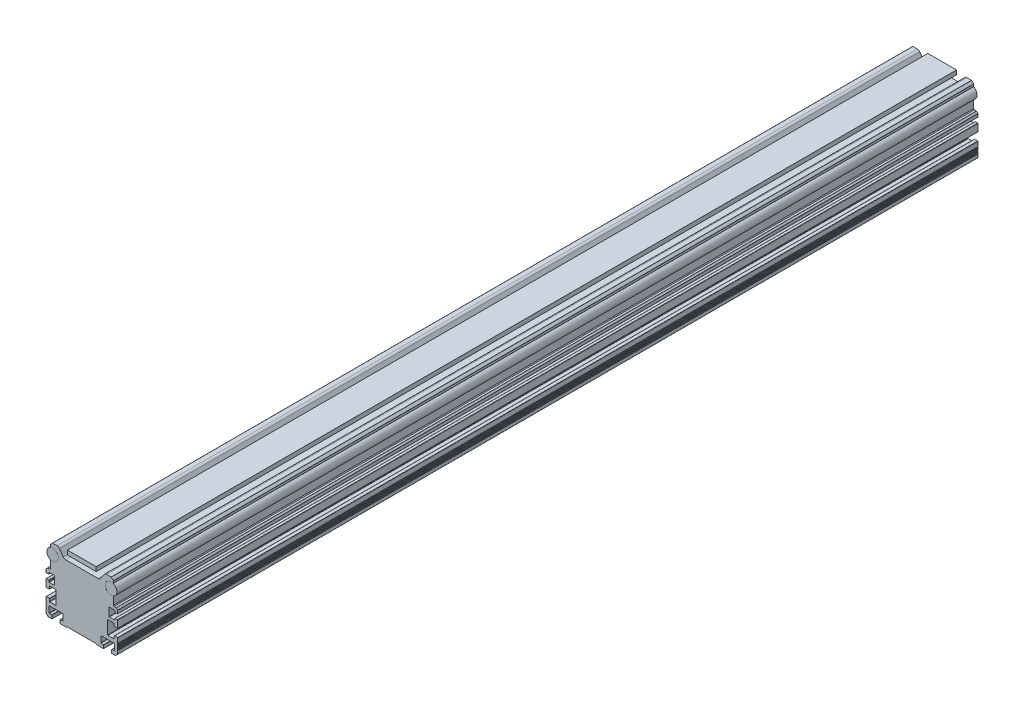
from build123d import *

# Parameters (mm, degrees)
EXTRUDE_1_DEPTH     = 600
SKETCH_3_R          = 0.25
CUT_EXTRUDE_1_DEPTH = 604.068916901
SKETCH_5_R          = 4
EXTRUDE_2_DEPTH     = 600
EXTRUDE_2_2_DEPTH   = 600
SKETCH_6_W          = 20
SKETCH_6_H          = 3
EXTRUDE_3_DEPTH     = 600


with BuildPart() as part:
    # Sketch 2 → Extrude 1 (new body)
    with BuildSketch(Plane.XY):
        with BuildLine():
            Line((4.012824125, 22.052472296), (4.012824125, 16.712270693))
            Line((4.012824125, 16.712270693), (3.512823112, 16.212270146))
            Line((3.512823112, 16.212270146), (2.095666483, 16.212270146))
            ThreePointArc((2.095666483, 16.212270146), (2.019129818, 16.197046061), (1.954245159, 16.153691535))
            Line((1.954245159, 16.153691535), (1.07140231, 15.270849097))
            ThreePointArc((1.07140231, 15.270849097), (1.028047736, 15.205964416), (1.012823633, 15.129427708))
            Line((1.012823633, 15.129427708), (1.012823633, 13.106220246))
            ThreePointArc((1.012823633, 13.106220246), (1.071402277, 12.96479889), (1.212823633, 12.906220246))
            Line((1.212823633, 12.906220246), (2.812823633, 12.906220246))
            ThreePointArc((2.812823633, 12.906220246), (2.95424499, 12.96479889), (3.012823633, 13.106220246))
            Line((3.012823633, 13.106220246), (3.012823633, 13.956220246))
            ThreePointArc((3.012823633, 13.956220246), (3.071402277, 14.097641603), (3.212823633, 14.156220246))
            Line((3.212823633, 14.156220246), (6.812823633, 14.156220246))
            ThreePointArc((6.812823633, 14.156220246), (6.95424499, 14.097641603), (7.012823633, 13.956220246))
            Line((7.012823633, 13.956220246), (7.012823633, 8.356220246))
            ThreePointArc((7.012823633, 8.356220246), (6.95424499, 8.21479889), (6.812823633, 8.156220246))
            Line((6.812823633, 8.156220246), (3.212823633, 8.156220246))
            ThreePointArc((3.212823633, 8.156220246), (3.071402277, 8.21479889), (3.012823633, 8.356220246))
            Line((3.012823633, 8.356220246), (3.012823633, 9.206220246))
            ThreePointArc((3.012823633, 9.206220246), (2.95424499, 9.347641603), (2.812823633, 9.406220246))
            Line((2.812823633, 9.406220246), (1.212823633, 9.406220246))
            ThreePointArc((1.212823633, 9.406220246), (1.071402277, 9.347641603), (1.012823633, 9.206220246))
            Line((1.012823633, 9.206220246), (1.012823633, 4.262270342))
            ThreePointArc((1.012823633, 4.262270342), (1.071402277, 4.120848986), (1.212823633, 4.062270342))
            Line((1.212823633, 4.062270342), (3.312823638, 4.062270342))
            ThreePointArc((3.312823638, 4.062270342), (3.454244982, 4.120848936), (3.512823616, 4.262270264))
            Line((3.512823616, 4.262270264), (3.512823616, 5.861774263))
            ThreePointArc((3.512823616, 5.861774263), (3.571226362, 6.0035162), (3.712823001, 6.062270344))
            Line((3.712823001, 6.062270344), (7.812823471, 6.062270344))
            ThreePointArc((7.812823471, 6.062270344), (7.954244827, 6.0036917), (8.012823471, 5.862270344))
            Line((8.012823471, 5.862270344), (8.012823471, -3.237729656))
            ThreePointArc((8.012823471, -3.237729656), (7.954244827, -3.379151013), (7.812823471, -3.437729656))
            Line((7.812823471, -3.437729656), (3.712822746, -3.437729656))
            ThreePointArc((3.712822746, -3.437729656), (3.571191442, -3.378940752), (3.512823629, -3.237135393))
            Line((3.512823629, -3.237135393), (3.512822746, -1.637729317))
            ThreePointArc((3.512822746, -1.637729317), (3.454244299, -1.496308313), (3.312823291, -1.437729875))
            Line((3.312823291, -1.437729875), (1.21282316, -1.437729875))
            ThreePointArc((1.21282316, -1.437729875), (1.071401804, -1.496308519), (1.01282316, -1.637729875))
            Line((1.01282316, -1.637729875), (1.01282316, -11.404886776))
            ThreePointArc((1.01282316, -11.404886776), (1.028047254, -11.481423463), (1.071401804, -11.546308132))
            Line((1.071401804, -11.546308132), (2.454245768, -12.929152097))
            ThreePointArc((2.454245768, -12.929152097), (2.519130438, -12.972506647), (2.595667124, -12.98773074))
            Line((2.595667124, -12.98773074), (5.062823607, -12.98773074))
            ThreePointArc((5.062823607, -12.98773074), (5.204244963, -12.929152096), (5.262823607, -12.78773074))
            Line((5.262823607, -12.78773074), (5.262823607, -10.687729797))
            ThreePointArc((5.262823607, -10.687729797), (5.204245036, -10.546308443), (5.062823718, -10.487729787))
            Line((5.062823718, -10.487729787), (3.462823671, -10.487729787))
            ThreePointArc((3.462823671, -10.487729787), (3.321402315, -10.429151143), (3.262823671, -10.287729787))
            Line((3.262823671, -10.287729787), (3.262823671, -6.187729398))
            ThreePointArc((3.262823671, -6.187729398), (3.321402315, -6.046308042), (3.462823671, -5.987729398))
            Line((3.462823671, -5.987729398), (12.562823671, -5.987729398))
            ThreePointArc((12.562823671, -5.987729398), (12.704245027, -6.046308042), (12.762823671, -6.187729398))
            Line((12.762823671, -6.187729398), (12.762823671, -10.287730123))
            ThreePointArc((12.762823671, -10.287730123), (12.704245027, -10.429151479), (12.562823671, -10.487730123))
            Line((12.562823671, -10.487730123), (10.962823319, -10.487730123))
            ThreePointArc((10.962823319, -10.487730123), (10.821402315, -10.54630857), (10.762823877, -10.687729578))
            Line((10.762823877, -10.687729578), (10.762823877, -12.787729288))
            ThreePointArc((10.762823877, -12.787729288), (10.8214025, -12.929150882), (10.962824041, -12.987729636))
            Line((10.962824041, -12.987729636), (15.429981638, -12.987729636))
            ThreePointArc((15.429981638, -12.987729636), (15.506518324, -12.972505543), (15.571402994, -12.929150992))
            Line((15.571402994, -12.929150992), (16.012825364, -12.487728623))
            Line((16.012825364, -12.487728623), (26.012825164, -12.487728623))
            Line((26.012825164, -12.487728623), (36.012824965, -12.487728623))
            Line((36.012824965, -12.487728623), (36.454247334, -12.929150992))
            ThreePointArc((36.454247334, -12.929150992), (36.519132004, -12.972505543), (36.595668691, -12.987729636))
            Line((36.595668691, -12.987729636), (41.062826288, -12.987729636))
            ThreePointArc((41.062826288, -12.987729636), (41.204247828, -12.929150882), (41.262826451, -12.787729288))
            Line((41.262826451, -12.787729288), (41.262826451, -10.687729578))
            ThreePointArc((41.262826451, -10.687729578), (41.204248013, -10.54630857), (41.062827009, -10.487730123))
            Line((41.062827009, -10.487730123), (39.462826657, -10.487730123))
            ThreePointArc((39.462826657, -10.487730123), (39.321405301, -10.429151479), (39.262826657, -10.287730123))
            Line((39.262826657, -10.287730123), (39.262826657, -6.187729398))
            ThreePointArc((39.262826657, -6.187729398), (39.321405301, -6.046308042), (39.462826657, -5.987729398))
            Line((39.462826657, -5.987729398), (48.562826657, -5.987729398))
            ThreePointArc((48.562826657, -5.987729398), (48.704248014, -6.046308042), (48.762826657, -6.187729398))
            Line((48.762826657, -6.187729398), (48.762826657, -10.287729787))
            ThreePointArc((48.762826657, -10.287729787), (48.704248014, -10.429151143), (48.562826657, -10.487729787))
            Line((48.562826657, -10.487729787), (46.962826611, -10.487729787))
            ThreePointArc((46.962826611, -10.487729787), (46.821405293, -10.546308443), (46.762826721, -10.687729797))
            Line((46.762826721, -10.687729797), (46.762826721, -12.78773074))
            ThreePointArc((46.762826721, -12.78773074), (46.821405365, -12.929152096), (46.962826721, -12.98773074))
            Line((46.962826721, -12.98773074), (49.429983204, -12.98773074))
            ThreePointArc((49.429983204, -12.98773074), (49.506519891, -12.972506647), (49.57140456, -12.929152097))
            Line((49.57140456, -12.929152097), (50.954248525, -11.546308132))
            ThreePointArc((50.954248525, -11.546308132), (50.997603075, -11.481423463), (51.012827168, -11.404886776))
            Line((51.012827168, -11.404886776), (51.012827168, -1.637729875))
            ThreePointArc((51.012827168, -1.637729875), (50.954248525, -1.496308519), (50.812827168, -1.437729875))
            Line((50.812827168, -1.437729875), (48.712827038, -1.437729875))
            ThreePointArc((48.712827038, -1.437729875), (48.57140603, -1.496308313), (48.512827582, -1.637729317))
            Line((48.512827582, -1.637729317), (48.5128267, -3.237135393))
            ThreePointArc((48.5128267, -3.237135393), (48.454458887, -3.378940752), (48.312827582, -3.437729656))
            Line((48.312827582, -3.437729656), (44.212826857, -3.437729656))
            ThreePointArc((44.212826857, -3.437729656), (44.071405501, -3.379151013), (44.012826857, -3.237729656))
            Line((44.012826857, -3.237729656), (44.012826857, 5.862270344))
            ThreePointArc((44.012826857, 5.862270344), (44.071405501, 6.0036917), (44.212826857, 6.062270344))
            Line((44.212826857, 6.062270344), (48.312827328, 6.062270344))
            ThreePointArc((48.312827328, 6.062270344), (48.454423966, 6.0035162), (48.512826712, 5.861774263))
            Line((48.512826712, 5.861774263), (48.512826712, 4.262270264))
            ThreePointArc((48.512826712, 4.262270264), (48.571405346, 4.120848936), (48.71282669, 4.062270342))
            Line((48.71282669, 4.062270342), (50.812826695, 4.062270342))
            ThreePointArc((50.812826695, 4.062270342), (50.954248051, 4.120848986), (51.012826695, 4.262270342))
            Line((51.012826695, 4.262270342), (51.012826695, 9.206220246))
            ThreePointArc((51.012826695, 9.206220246), (50.954248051, 9.347641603), (50.812826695, 9.406220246))
            Line((50.812826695, 9.406220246), (49.212826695, 9.406220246))
            ThreePointArc((49.212826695, 9.406220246), (49.071405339, 9.347641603), (49.012826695, 9.206220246))
            Line((49.012826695, 9.206220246), (49.012826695, 8.356220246))
            ThreePointArc((49.012826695, 8.356220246), (48.954248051, 8.21479889), (48.812826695, 8.156220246))
            Line((48.812826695, 8.156220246), (45.212826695, 8.156220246))
            ThreePointArc((45.212826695, 8.156220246), (45.071405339, 8.21479889), (45.012826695, 8.356220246))
            Line((45.012826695, 8.356220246), (45.012826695, 13.956220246))
            ThreePointArc((45.012826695, 13.956220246), (45.071405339, 14.097641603), (45.212826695, 14.156220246))
            Line((45.212826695, 14.156220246), (48.812826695, 14.156220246))
            ThreePointArc((48.812826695, 14.156220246), (48.954248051, 14.097641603), (49.012826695, 13.956220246))
            Line((49.012826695, 13.956220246), (49.012826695, 13.106220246))
            ThreePointArc((49.012826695, 13.106220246), (49.071405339, 12.96479889), (49.212826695, 12.906220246))
            Line((49.212826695, 12.906220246), (50.812826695, 12.906220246))
            ThreePointArc((50.812826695, 12.906220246), (50.954248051, 12.96479889), (51.012826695, 13.106220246))
            Line((51.012826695, 13.106220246), (51.012826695, 15.129427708))
            ThreePointArc((51.012826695, 15.129427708), (50.997602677, 15.205964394), (50.954248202, 15.270849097))
            Line((50.954248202, 15.270849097), (50.071405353, 16.153691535))
            ThreePointArc((50.071405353, 16.153691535), (50.006520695, 16.197046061), (49.92998403, 16.212270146))
            Line((49.92998403, 16.212270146), (48.5128274, 16.212270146))
            Line((48.5128274, 16.212270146), (48.012826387, 16.712270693))
            Line((48.012826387, 16.712270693), (48.012826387, 22.052472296))
            ThreePointArc((48.012826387, 22.052472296), (47.928296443, 22.215771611), (47.746159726, 22.241034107))
            ThreePointArc((47.746159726, 22.241034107), (45.340159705, 22.158780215), (43.322706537, 23.472357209))
            ThreePointArc((43.322706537, 23.472357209), (42.967402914, 23.523986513), (43.030110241, 23.877503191))
            ThreePointArc((43.030110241, 23.877503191), (42.412826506, 26.012270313), (43.030110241, 28.147037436))
            ThreePointArc((43.030110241, 28.147037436), (42.967402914, 28.500554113), (43.322706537, 28.552183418))
            ThreePointArc((43.322706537, 28.552183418), (45.340159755, 29.865760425), (47.746159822, 29.783506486))
            ThreePointArc((47.746159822, 29.783506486), (47.928296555, 29.80876888), (48.012826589, 29.97206815))
            Line((48.012826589, 29.97206815), (48.012826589, 31.429426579))
            ThreePointArc((48.012826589, 31.429426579), (47.99760252, 31.505963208), (47.954248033, 31.570847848))
            Line((47.954248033, 31.570847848), (46.571405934, 32.953691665))
            ThreePointArc((46.571405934, 32.953691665), (46.506521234, 32.997046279), (46.42998449, 33.012270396))
            Line((46.42998449, 33.012270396), (43.290054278, 33.012270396))
            ThreePointArc((43.290054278, 33.012270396), (42.366557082, 32.786292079), (41.651750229, 32.159423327))
            Line((41.651750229, 32.159423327), (38.994948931, 28.365118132))
            ThreePointArc((38.994948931, 28.365118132), (38.280142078, 27.738249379), (37.356644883, 27.512271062))
            Line((37.356644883, 27.512271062), (26.012825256, 27.512271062))
            Line((26.012825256, 27.512271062), (14.669005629, 27.512271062))
            ThreePointArc((14.669005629, 27.512271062), (13.745508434, 27.738249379), (13.030701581, 28.365118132))
            Line((13.030701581, 28.365118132), (10.373900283, 32.159423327))
            ThreePointArc((10.373900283, 32.159423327), (9.65909343, 32.786292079), (8.735596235, 33.012270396))
            Line((8.735596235, 33.012270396), (5.595666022, 33.012270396))
            ThreePointArc((5.595666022, 33.012270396), (5.519129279, 32.997046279), (5.454244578, 32.953691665))
            Line((5.454244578, 32.953691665), (4.071402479, 31.570847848))
            ThreePointArc((4.071402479, 31.570847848), (4.028047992, 31.505963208), (4.012823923, 31.429426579))
            Line((4.012823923, 31.429426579), (4.012823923, 29.97206815))
            ThreePointArc((4.012823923, 29.97206815), (4.097353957, 29.80876888), (4.27949069, 29.783506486))
            ThreePointArc((4.27949069, 29.783506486), (6.685490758, 29.865760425), (8.702943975, 28.552183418))
            ThreePointArc((8.702943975, 28.552183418), (9.058247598, 28.500554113), (8.995540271, 28.147037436))
            ThreePointArc((8.995540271, 28.147037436), (9.612824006, 26.012270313), (8.995540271, 23.877503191))
            ThreePointArc((8.995540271, 23.877503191), (9.058247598, 23.523986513), (8.702943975, 23.472357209))
            ThreePointArc((8.702943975, 23.472357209), (6.685490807, 22.158780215), (4.279490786, 22.241034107))
            ThreePointArc((4.279490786, 22.241034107), (4.097354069, 22.215771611), (4.012824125, 22.052472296))
        make_face()
    extrude(amount=EXTRUDE_1_DEPTH)

    # Sketch 3 → Cut-Extrude 1 (cut, through all)
    with BuildSketch(Plane.XY.offset(600)):
        with Locations((1.01282316, -8.98773074)):
            Circle(SKETCH_3_R)
        with Locations((1.01282316, -7.98773074)):
            Circle(SKETCH_3_R)
        with Locations((1.01282316, -6.98773074)):
            Circle(SKETCH_3_R)
        with Locations((1.01282316, -5.98773074)):
            Circle(SKETCH_3_R)
        with Locations((1.01282316, -4.98773074)):
            Circle(SKETCH_3_R)
        with Locations((51.012827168, -4.98773074)):
            Circle(SKETCH_3_R)
        with Locations((51.012827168, -5.98773074)):
            Circle(SKETCH_3_R)
        with Locations((51.012827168, -6.98773074)):
            Circle(SKETCH_3_R)
        with Locations((51.012827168, -7.98773074)):
            Circle(SKETCH_3_R)
        with Locations((51.012827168, -8.98773074)):
            Circle(SKETCH_3_R)
    extrude(amount=-CUT_EXTRUDE_1_DEPTH, mode=Mode.SUBTRACT)


with BuildPart() as body_2:
    # Sketch 5 → Extrude 2 (new body)
    with BuildSketch(Plane.XY.offset(600)):
        with Locations((5.612824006, 26.012270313)):
            Circle(SKETCH_5_R)
    extrude(amount=-EXTRUDE_2_DEPTH)


with BuildPart() as body_3:
    # Sketch 5 → Extrude 2 2 (new body)
    with BuildSketch(Plane.XY.offset(600)):
        with Locations((46.412826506, 26.012270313)):
            Circle(SKETCH_5_R)
    extrude(amount=-EXTRUDE_2_2_DEPTH)


with BuildPart() as body_4:
    # Sketch 6 → Extrude 3 (new body)
    with BuildSketch(Plane.XY.offset(600)):
        with Locations((26.012825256, 32.512271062)):
            Rectangle(SKETCH_6_W, SKETCH_6_H)
    extrude(amount=-EXTRUDE_3_DEPTH)


solid = Compound([part.part, body_2.part, body_3.part, body_4.part])
